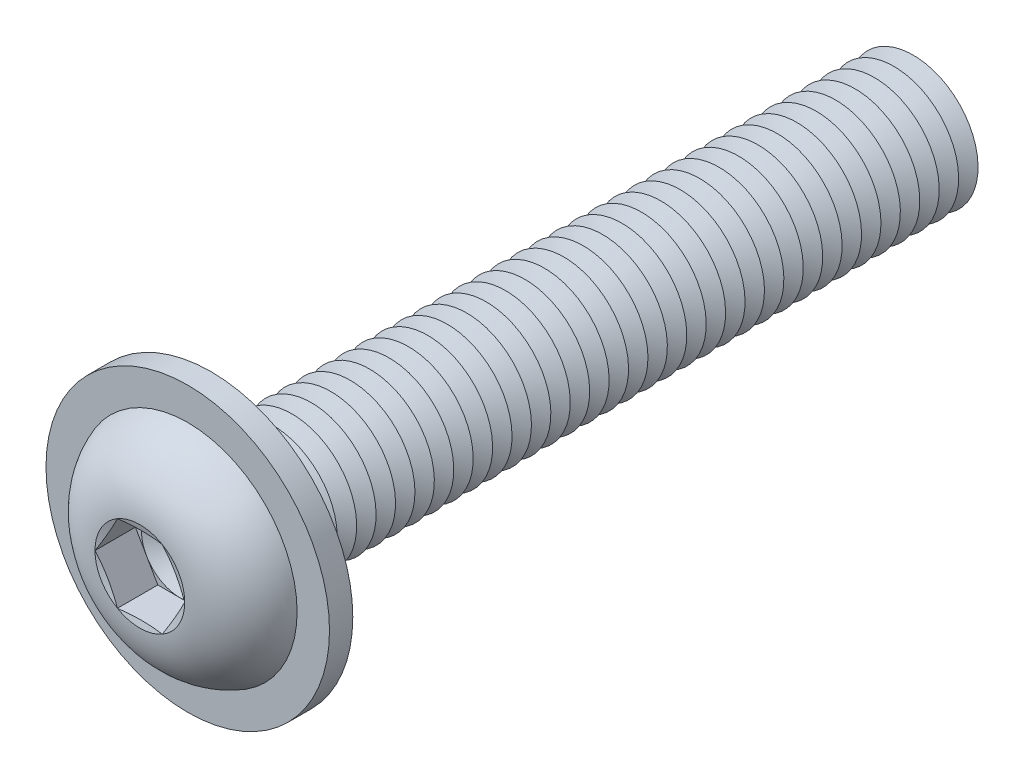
from build123d import *

# Parameters (mm, degrees)
FILLET1_R           = 0.75
LPATTERN1_COUNT     = 36
LPATTERN1_PITCH     = 1.5
CUT_EXTRUDE1_DEPTH  = 3.12
SKETCH5_R           = 10.95
SKETCH5_R_2         = 5.75
BOSS_EXTRUDE1_DEPTH = 1.8


with BuildPart() as part:
    # Sketch1 → Revolve1 (revolve)
    with BuildSketch(Plane(origin=(0, 0, 0), x_dir=(0, 0, -1), z_dir=(1, 0, 0))):
        with BuildLine():
            Line((0, 5), (0, 8.75))
            ThreePointArc((0, 8.75), (-3.814142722, 7.21429474), (-5.5, 3.4641))
            Line((-5.5, 3.4641), (-5.035898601, 1.73205))
            Line((-5.035898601, 1.73205), (-5.5, 1.73205))
            Line((-5.5, 1.73205), (-5.5, 0))
            Line((-5.5, 0), (55, 0))
            Line((55, 0), (55, 5))
            Line((55, 5), (0, 5))
        make_face()
    revolve(axis=Axis((0, 0, -55), (0, 0, 1)))

    # Fillet1
    fillet1_edges = [part.edges().sort_by_distance(p)[0] for p in [
        (0, -5, 0),
    ]]
    fillet(fillet1_edges, radius=FILLET1_R)

    # Sketch2 → Cut-Revolve1 (revolve, cut)
    with BuildSketch(Plane(origin=(0, 0, 0), x_dir=(0, 0, -1), z_dir=(1, 0, 0))):
        Polygon((54.25, 5), (55.75, 5), (55, 3.700961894), align=None)
    cut_revolve1 = revolve(axis=Axis((0, 0, -55), (0, 0, -1)), mode=Mode.SUBTRACT)

    # LPattern1: Cut-Revolve1 ×36
    with Locations(*[(0, 0, i * LPATTERN1_PITCH) for i in range(1, LPATTERN1_COUNT)]):
        add(cut_revolve1, mode=Mode.SUBTRACT)

    # Sketch3 → Cut-Extrude1 (cut)
    with BuildSketch(Plane.XY.offset(5.5)):
        Polygon((1.73205, 2.999998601), (-1.73205, 2.999998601), (-3.4641, 0), (-1.73205, -2.999998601), (1.73205, -2.999998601), (3.4641, 0), align=None)
    extrude(amount=-CUT_EXTRUDE1_DEPTH, mode=Mode.SUBTRACT)

    # Cut-Extrude2 cone 1 section (on through the dimple's axis) → Cut-Extrude2 (revolve, cut)
    with BuildSketch(Plane(origin=(0, 0, 2.38), x_dir=(0, -1, 0), z_dir=(1, 0, 0))):
        Polygon((0, 0), (2.999998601, 0), (0, 1.73205), align=None)
    revolve(axis=Axis((0, 0, 2.38), (0, 0, -1)), mode=Mode.SUBTRACT)

    # Sketch5 → Boss-Extrude1 (add)
    with BuildSketch(Plane(origin=(0, 0, 0), x_dir=(-1, 0, 0), z_dir=(0, 0, -1))):
        with Locations(Location((0, 0, 0), (0, 0, 90))):
            Circle(SKETCH5_R)
        Circle(SKETCH5_R_2, mode=Mode.SUBTRACT)
    extrude(amount=-BOSS_EXTRUDE1_DEPTH)


solid = part.part
